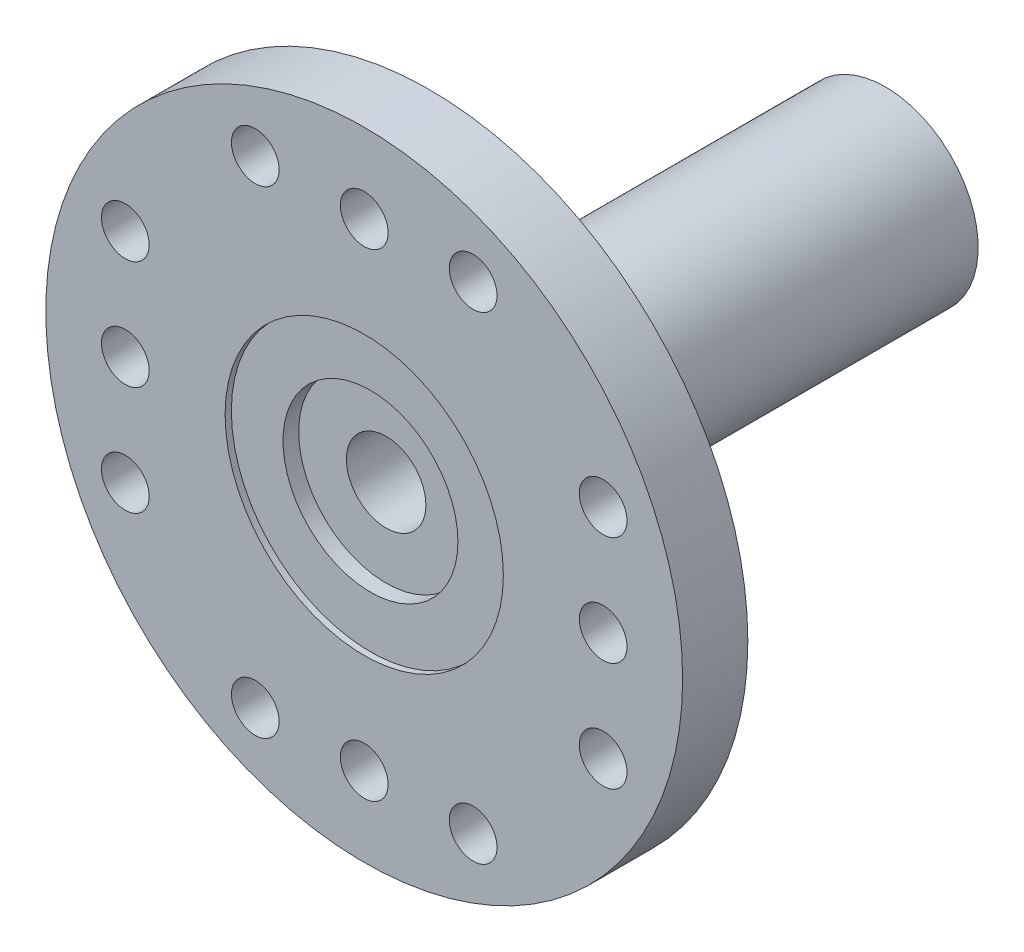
from build123d import *

# Parameters (mm, degrees)
SKETCH1_R          = 10.1727
EXTRUDE1_DEPTH     = 2.0828
SKETCH2_R          = 4.699
EXTRUDE2_DEPTH     = 3.302
SKETCH3_R          = 2.9591
EXTRUDE3_DEPTH     = 11.27
SKETCH4_R          = 4.445
CUT_EXTRUDE1_DEPTH = 0.2
SKETCH6_R          = 2.794
CUT_EXTRUDE2_DEPTH = 0.5
SKETCH7_R          = 1.27
CUT_EXTRUDE3_DEPTH = 22.483093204
CUT_EXTRUDE4_REACH = 24.008
SKETCH8_R          = 0.762
CIRPATTERN1_COUNT  = 4


with BuildPart() as part:
    # Sketch1 → Extrude1 (new body)
    with BuildSketch(Plane.XY):
        Circle(SKETCH1_R)
    extrude(amount=EXTRUDE1_DEPTH)

    # Sketch2 → Extrude2 (add)
    with BuildSketch(Plane(origin=(0, 0, 0), x_dir=(-1, 0, 0), z_dir=(0, 0, -1))):
        with Locations(Location((0, 0, 0), (0, 0, 180))):
            Circle(SKETCH2_R)
    extrude(amount=EXTRUDE2_DEPTH)

    # Sketch3 → Extrude3 (add)
    with BuildSketch(Plane(origin=(0, 0, -3.302), x_dir=(-1, 0, 0), z_dir=(0, 0, -1))):
        Circle(SKETCH3_R)
    extrude(amount=EXTRUDE3_DEPTH)

    # Sketch4 → Cut-Extrude1 (cut)
    with BuildSketch(Plane.XY.offset(2.0828)):
        Circle(SKETCH4_R)
    extrude(amount=-CUT_EXTRUDE1_DEPTH, mode=Mode.SUBTRACT)

    # Sketch6 → Cut-Extrude2 (cut)
    with BuildSketch(Plane.XY.offset(1.8828)):
        Circle(SKETCH6_R)
    extrude(amount=-CUT_EXTRUDE2_DEPTH, mode=Mode.SUBTRACT)

    # Sketch7 → Cut-Extrude3 (cut, through all)
    with BuildSketch(Plane.XY.offset(1.3828)):
        Circle(SKETCH7_R)
    extrude(amount=-CUT_EXTRUDE3_DEPTH, mode=Mode.SUBTRACT)

    # Sketch8 → Cut-Extrude4 (cut, up to next)
    with BuildSketch(Plane.XY.offset(2.0828), mode=Mode.PRIVATE) as cut_extrude4_sk1:
        with Locations((7.6327, 0)):
            Circle(SKETCH8_R)
    cut_extrude4_tool1 = extrude(cut_extrude4_sk1.sketch, amount=-CUT_EXTRUDE4_REACH, mode=Mode.PRIVATE) & part.part
    # Sketch8 → Cut-Extrude4 (cut, up to next)
    with BuildSketch(Plane.XY.offset(2.0828), mode=Mode.PRIVATE) as cut_extrude4_sk2:
        with Locations((7.6327, -3.4798)):
            Circle(SKETCH8_R)
    cut_extrude4_tool2 = extrude(cut_extrude4_sk2.sketch, amount=-CUT_EXTRUDE4_REACH, mode=Mode.PRIVATE) & part.part
    # Sketch8 → Cut-Extrude4 (cut, up to next)
    with BuildSketch(Plane.XY.offset(2.0828), mode=Mode.PRIVATE) as cut_extrude4_sk3:
        with Locations((7.6327, 3.4798)):
            Circle(SKETCH8_R)
    cut_extrude4_tool3 = extrude(cut_extrude4_sk3.sketch, amount=-CUT_EXTRUDE4_REACH, mode=Mode.PRIVATE) & part.part
    cut_extrude4_1 = cut_extrude4_tool1.solids().sort_by_distance((7.6327, 0, 2.0828))[0]
    add(cut_extrude4_1, mode=Mode.SUBTRACT)
    cut_extrude4_2 = cut_extrude4_tool2.solids().sort_by_distance((7.6327, -3.4798, 2.0828))[0]
    add(cut_extrude4_2, mode=Mode.SUBTRACT)
    cut_extrude4_3 = cut_extrude4_tool3.solids().sort_by_distance((7.6327, 3.4798, 2.0828))[0]
    add(cut_extrude4_3, mode=Mode.SUBTRACT)
    cut_extrude4 = cut_extrude4_1 + cut_extrude4_2 + cut_extrude4_3  # Cut-Extrude4 as one shape, for the pattern or mirror that repeats it

    # CirPattern1: Cut-Extrude4 ×4 about axis
    cirpattern1_axis = Axis((0, 0, 0), (0, 0, 1))
    for i in range(1, CIRPATTERN1_COUNT):
        add(cut_extrude4.rotate(cirpattern1_axis, i * 360 / CIRPATTERN1_COUNT), mode=Mode.SUBTRACT)


solid = part.part
